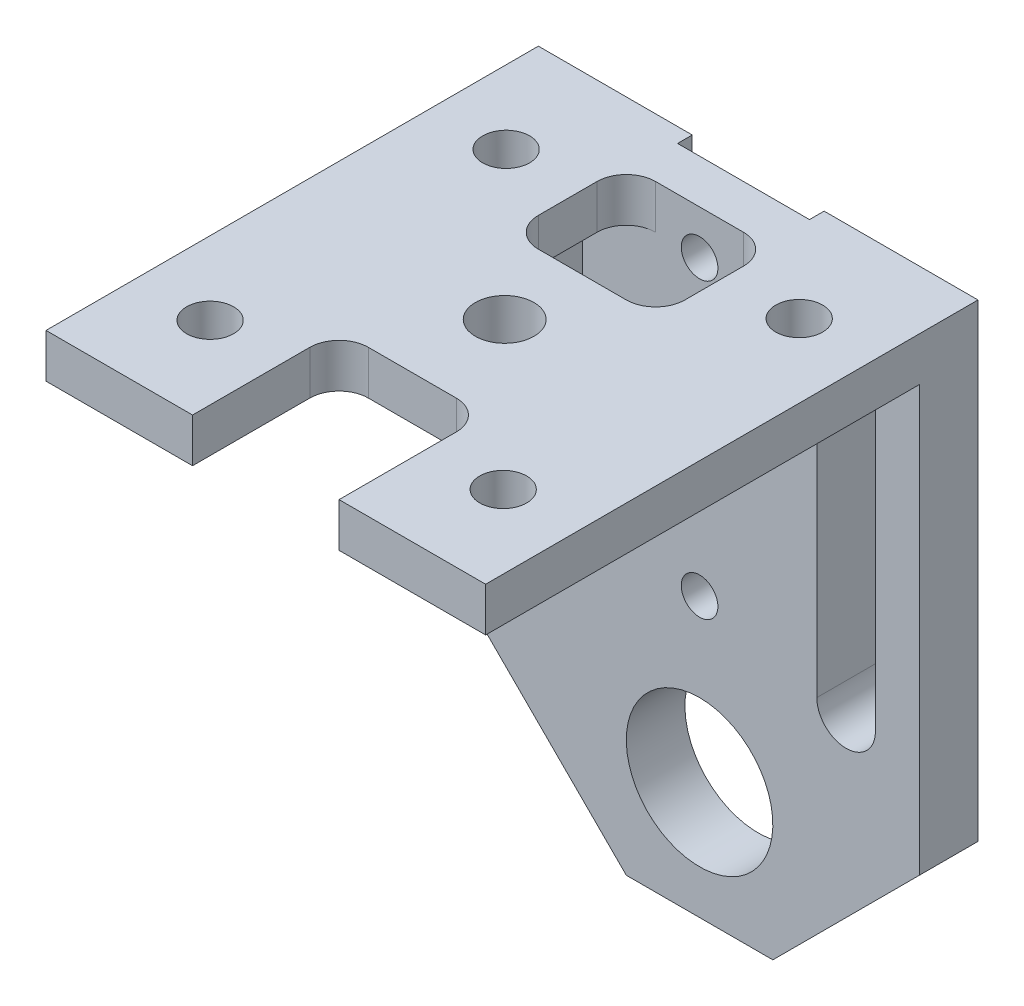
ISO-10303-21;
HEADER;
FILE_DESCRIPTION(('STEP AP214'),'2;1');
FILE_NAME('part.step','',(''),(''),'','','');
FILE_SCHEMA(('AUTOMOTIVE_DESIGN { 1 0 10303 214 1 1 1 1 }'));
ENDSEC;
DATA;
#1=APPLICATION_CONTEXT('core data for automotive mechanical design processes');
#2=APPLICATION_PROTOCOL_DEFINITION('international standard','automotive_design',2000,#1);
#3=PRODUCT_CONTEXT('',#1,'mechanical');
#4=PRODUCT('Part','Part','',(#3));
#5=PRODUCT_RELATED_PRODUCT_CATEGORY('part','',(#4));
#6=PRODUCT_DEFINITION_FORMATION('','',#4);
#7=PRODUCT_DEFINITION_CONTEXT('part definition',#1,'design');
#8=PRODUCT_DEFINITION('design','',#6,#7);
#9=PRODUCT_DEFINITION_SHAPE('','',#8);
#10=(LENGTH_UNIT() NAMED_UNIT(*) SI_UNIT(.MILLI.,.METRE.));
#11=(NAMED_UNIT(*) PLANE_ANGLE_UNIT() SI_UNIT($,.RADIAN.));
#12=(NAMED_UNIT(*) SI_UNIT($,.STERADIAN.) SOLID_ANGLE_UNIT());
#13=UNCERTAINTY_MEASURE_WITH_UNIT(LENGTH_MEASURE(1.E-05),#10,'distance_accuracy_value','');
#14=(GEOMETRIC_REPRESENTATION_CONTEXT(3) GLOBAL_UNCERTAINTY_ASSIGNED_CONTEXT((#13)) GLOBAL_UNIT_ASSIGNED_CONTEXT((#10,
#11,#12)) REPRESENTATION_CONTEXT('',''));
#15=CARTESIAN_POINT('',(0.,0.,0.));
#16=DIRECTION('',(0.,0.,1.));
#17=DIRECTION('',(1.,0.,0.));
#18=AXIS2_PLACEMENT_3D('',#15,#16,#17);
#19=CARTESIAN_POINT('',(30.,0.,0.));
#20=DIRECTION('',(0.,0.,-1.));
#21=DIRECTION('',(-1.,0.,0.));
#22=AXIS2_PLACEMENT_3D('',#19,#20,#21);
#23=PLANE('',#22);
#24=DIRECTION('',(-1.,0.,0.));
#25=VECTOR('',#24,1.);
#26=CARTESIAN_POINT('',(30.,0.,0.));
#27=LINE('',#26,#25);
#28=CARTESIAN_POINT('',(10.,0.,0.));
#29=VERTEX_POINT('',#28);
#30=CARTESIAN_POINT('',(0.,0.,0.));
#31=VERTEX_POINT('',#30);
#32=EDGE_CURVE('E493',#29,#31,#27,.T.);
#33=ORIENTED_EDGE('',*,*,#32,.F.);
#34=DIRECTION('',(0.,1.,0.));
#35=VECTOR('',#34,1.);
#36=CARTESIAN_POINT('',(10.,-39.001,0.));
#37=LINE('',#36,#35);
#38=CARTESIAN_POINT('',(10.,3.,0.));
#39=VERTEX_POINT('',#38);
#40=EDGE_CURVE('E418',#29,#39,#37,.T.);
#41=ORIENTED_EDGE('',*,*,#40,.T.);
#42=DIRECTION('',(-1.,0.,0.));
#43=VECTOR('',#42,1.);
#44=CARTESIAN_POINT('',(30.,3.,0.));
#45=LINE('',#44,#43);
#46=CARTESIAN_POINT('',(0.,3.,0.));
#47=VERTEX_POINT('',#46);
#48=EDGE_CURVE('E466',#39,#47,#45,.T.);
#49=ORIENTED_EDGE('',*,*,#48,.T.);
#50=DIRECTION('',(0.,-1.,0.));
#51=VECTOR('',#50,1.);
#52=CARTESIAN_POINT('',(0.,0.,0.));
#53=LINE('',#52,#51);
#54=EDGE_CURVE('E452',#47,#31,#53,.T.);
#55=ORIENTED_EDGE('',*,*,#54,.T.);
#56=EDGE_LOOP('',(#33,#41,#49,#55));
#57=FACE_BOUND('',#56,.T.);
#58=ADVANCED_FACE('F36',(#57),#23,.F.);
#59=CARTESIAN_POINT('',(30.,3.,0.));
#60=VERTEX_POINT('',#59);
#61=CARTESIAN_POINT('',(20.,3.,0.));
#62=VERTEX_POINT('',#61);
#63=EDGE_CURVE('E478',#60,#62,#45,.T.);
#64=ORIENTED_EDGE('',*,*,#63,.T.);
#65=DIRECTION('',(0.,1.,0.));
#66=VECTOR('',#65,1.);
#67=CARTESIAN_POINT('',(20.,-39.001,0.));
#68=LINE('',#67,#66);
#69=CARTESIAN_POINT('',(20.,0.,0.));
#70=VERTEX_POINT('',#69);
#71=EDGE_CURVE('E417',#70,#62,#68,.T.);
#72=ORIENTED_EDGE('',*,*,#71,.F.);
#73=CARTESIAN_POINT('',(30.,0.,0.));
#74=VERTEX_POINT('',#73);
#75=EDGE_CURVE('E494',#74,#70,#27,.T.);
#76=ORIENTED_EDGE('',*,*,#75,.F.);
#77=DIRECTION('',(0.,-1.,0.));
#78=VECTOR('',#77,1.);
#79=CARTESIAN_POINT('',(30.,0.,0.));
#80=LINE('',#79,#78);
#81=EDGE_CURVE('E453',#60,#74,#80,.T.);
#82=ORIENTED_EDGE('',*,*,#81,.F.);
#83=EDGE_LOOP('',(#64,#72,#76,#82));
#84=FACE_BOUND('',#83,.T.);
#85=ADVANCED_FACE('F647',(#84),#23,.F.);
#86=CARTESIAN_POINT('',(30.,0.,0.));
#87=DIRECTION('',(0.,1.,0.));
#88=DIRECTION('',(0.,0.,1.));
#89=AXIS2_PLACEMENT_3D('',#86,#87,#88);
#90=PLANE('',#89);
#91=CARTESIAN_POINT('',(15.,0.,-16.3));
#92=DIRECTION('',(0.,-1.,0.));
#93=DIRECTION('',(0.,0.,-1.));
#94=AXIS2_PLACEMENT_3D('',#91,#92,#93);
#95=CIRCLE('',#94,2.);
#96=CARTESIAN_POINT('',(15.,0.,-18.3));
#97=VERTEX_POINT('',#96);
#98=EDGE_CURVE('E856',#97,#97,#95,.T.);
#99=ORIENTED_EDGE('',*,*,#98,.F.);
#100=EDGE_LOOP('',(#99));
#101=FACE_BOUND('',#100,.T.);
#102=CARTESIAN_POINT('',(5.,0.,-26.4));
#103=DIRECTION('',(0.,1.,0.));
#104=DIRECTION('',(0.,0.,1.));
#105=AXIS2_PLACEMENT_3D('',#102,#103,#104);
#106=CIRCLE('',#105,1.6);
#107=CARTESIAN_POINT('',(5.,0.,-24.8));
#108=VERTEX_POINT('',#107);
#109=EDGE_CURVE('E425',#108,#108,#106,.T.);
#110=ORIENTED_EDGE('',*,*,#109,.T.);
#111=EDGE_LOOP('',(#110));
#112=FACE_BOUND('',#111,.T.);
#113=CARTESIAN_POINT('',(5.,0.,-6.2));
#114=DIRECTION('',(0.,1.,0.));
#115=DIRECTION('',(0.,0.,1.));
#116=AXIS2_PLACEMENT_3D('',#113,#114,#115);
#117=CIRCLE('',#116,1.6);
#118=CARTESIAN_POINT('',(5.,0.,-4.6));
#119=VERTEX_POINT('',#118);
#120=EDGE_CURVE('E431',#119,#119,#117,.T.);
#121=ORIENTED_EDGE('',*,*,#120,.T.);
#122=EDGE_LOOP('',(#121));
#123=FACE_BOUND('',#122,.T.);
#124=CARTESIAN_POINT('',(25.,0.,-6.2));
#125=DIRECTION('',(0.,1.,0.));
#126=DIRECTION('',(0.,0.,1.));
#127=AXIS2_PLACEMENT_3D('',#124,#125,#126);
#128=CIRCLE('',#127,1.6);
#129=CARTESIAN_POINT('',(25.,0.,-4.6));
#130=VERTEX_POINT('',#129);
#131=EDGE_CURVE('E437',#130,#130,#128,.T.);
#132=ORIENTED_EDGE('',*,*,#131,.T.);
#133=EDGE_LOOP('',(#132));
#134=FACE_BOUND('',#133,.T.);
#135=CARTESIAN_POINT('',(25.,0.,-26.4));
#136=DIRECTION('',(0.,1.,0.));
#137=DIRECTION('',(0.,0.,1.));
#138=AXIS2_PLACEMENT_3D('',#135,#136,#137);
#139=CIRCLE('',#138,1.6);
#140=CARTESIAN_POINT('',(25.,0.,-24.8));
#141=VERTEX_POINT('',#140);
#142=EDGE_CURVE('E443',#141,#141,#139,.T.);
#143=ORIENTED_EDGE('',*,*,#142,.T.);
#144=EDGE_LOOP('',(#143));
#145=FACE_BOUND('',#144,.T.);
#146=DIRECTION('',(-1.,0.,0.));
#147=VECTOR('',#146,1.);
#148=CARTESIAN_POINT('',(15.,0.,-21.6));
#149=LINE('',#148,#147);
#150=CARTESIAN_POINT('',(18.,0.,-21.6));
#151=VERTEX_POINT('',#150);
#152=CARTESIAN_POINT('',(12.,0.,-21.6));
#153=VERTEX_POINT('',#152);
#154=EDGE_CURVE('E360',#151,#153,#149,.T.);
#155=ORIENTED_EDGE('',*,*,#154,.F.);
#156=CARTESIAN_POINT('',(18.,0.,-23.6));
#157=DIRECTION('',(0.,1.,0.));
#158=DIRECTION('',(0.,0.,1.));
#159=AXIS2_PLACEMENT_3D('',#156,#157,#158);
#160=CIRCLE('',#159,2.);
#161=CARTESIAN_POINT('',(20.,0.,-23.6));
#162=VERTEX_POINT('',#161);
#163=EDGE_CURVE('E530',#151,#162,#160,.T.);
#164=ORIENTED_EDGE('',*,*,#163,.T.);
#165=DIRECTION('',(0.,0.,1.));
#166=VECTOR('',#165,1.);
#167=CARTESIAN_POINT('',(20.,0.,-21.6));
#168=LINE('',#167,#166);
#169=CARTESIAN_POINT('',(20.,0.,-27.6));
#170=VERTEX_POINT('',#169);
#171=EDGE_CURVE('E358',#170,#162,#168,.T.);
#172=ORIENTED_EDGE('',*,*,#171,.F.);
#173=CARTESIAN_POINT('',(18.,0.,-27.6));
#174=DIRECTION('',(0.,1.,0.));
#175=DIRECTION('',(0.,0.,1.));
#176=AXIS2_PLACEMENT_3D('',#173,#174,#175);
#177=CIRCLE('',#176,2.);
#178=CARTESIAN_POINT('',(18.,0.,-29.6));
#179=VERTEX_POINT('',#178);
#180=EDGE_CURVE('E555',#170,#179,#177,.T.);
#181=ORIENTED_EDGE('',*,*,#180,.T.);
#182=DIRECTION('',(-1.,0.,0.));
#183=VECTOR('',#182,1.);
#184=CARTESIAN_POINT('',(30.,0.,-29.6));
#185=LINE('',#184,#183);
#186=CARTESIAN_POINT('',(30.,0.,-29.6));
#187=VERTEX_POINT('',#186);
#188=EDGE_CURVE('E491',#187,#179,#185,.T.);
#189=ORIENTED_EDGE('',*,*,#188,.F.);
#190=DIRECTION('',(0.,0.,-1.));
#191=VECTOR('',#190,1.);
#192=CARTESIAN_POINT('',(30.,0.,0.));
#193=LINE('',#192,#191);
#194=EDGE_CURVE('E456',#74,#187,#193,.T.);
#195=ORIENTED_EDGE('',*,*,#194,.F.);
#196=ORIENTED_EDGE('',*,*,#75,.T.);
#197=DIRECTION('',(0.,0.,1.));
#198=VECTOR('',#197,1.);
#199=CARTESIAN_POINT('',(20.,0.,0.));
#200=LINE('',#199,#198);
#201=CARTESIAN_POINT('',(20.,0.,-8.));
#202=VERTEX_POINT('',#201);
#203=EDGE_CURVE('E399',#202,#70,#200,.T.);
#204=ORIENTED_EDGE('',*,*,#203,.F.);
#205=CARTESIAN_POINT('',(18.,0.,-8.));
#206=DIRECTION('',(0.,1.,0.));
#207=DIRECTION('',(0.,0.,1.));
#208=AXIS2_PLACEMENT_3D('',#205,#206,#207);
#209=CIRCLE('',#208,2.);
#210=CARTESIAN_POINT('',(18.,0.,-10.));
#211=VERTEX_POINT('',#210);
#212=EDGE_CURVE('E566',#202,#211,#209,.T.);
#213=ORIENTED_EDGE('',*,*,#212,.T.);
#214=DIRECTION('',(1.,0.,0.));
#215=VECTOR('',#214,1.);
#216=CARTESIAN_POINT('',(20.,0.,-10.));
#217=LINE('',#216,#215);
#218=CARTESIAN_POINT('',(12.,0.,-9.99999999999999));
#219=VERTEX_POINT('',#218);
#220=EDGE_CURVE('E403',#219,#211,#217,.T.);
#221=ORIENTED_EDGE('',*,*,#220,.F.);
#222=CARTESIAN_POINT('',(12.,0.,-8.));
#223=DIRECTION('',(0.,1.,0.));
#224=DIRECTION('',(0.,0.,1.));
#225=AXIS2_PLACEMENT_3D('',#222,#223,#224);
#226=CIRCLE('',#225,2.);
#227=CARTESIAN_POINT('',(10.,0.,-8.));
#228=VERTEX_POINT('',#227);
#229=EDGE_CURVE('E570',#219,#228,#226,.T.);
#230=ORIENTED_EDGE('',*,*,#229,.T.);
#231=DIRECTION('',(0.,0.,-1.));
#232=VECTOR('',#231,1.);
#233=CARTESIAN_POINT('',(10.,0.,-9.99999999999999));
#234=LINE('',#233,#232);
#235=EDGE_CURVE('E406',#29,#228,#234,.T.);
#236=ORIENTED_EDGE('',*,*,#235,.F.);
#237=ORIENTED_EDGE('',*,*,#32,.T.);
#238=DIRECTION('',(0.,0.,-1.));
#239=VECTOR('',#238,1.);
#240=CARTESIAN_POINT('',(0.,0.,0.));
#241=LINE('',#240,#239);
#242=CARTESIAN_POINT('',(0.,0.,-29.6));
#243=VERTEX_POINT('',#242);
#244=EDGE_CURVE('E469',#31,#243,#241,.T.);
#245=ORIENTED_EDGE('',*,*,#244,.T.);
#246=CARTESIAN_POINT('',(12.,0.,-29.6));
#247=VERTEX_POINT('',#246);
#248=EDGE_CURVE('E490',#247,#243,#185,.T.);
#249=ORIENTED_EDGE('',*,*,#248,.F.);
#250=CARTESIAN_POINT('',(12.,0.,-27.6));
#251=DIRECTION('',(0.,1.,0.));
#252=DIRECTION('',(0.,0.,1.));
#253=AXIS2_PLACEMENT_3D('',#250,#251,#252);
#254=CIRCLE('',#253,2.);
#255=CARTESIAN_POINT('',(10.,0.,-27.6));
#256=VERTEX_POINT('',#255);
#257=EDGE_CURVE('E560',#247,#256,#254,.T.);
#258=ORIENTED_EDGE('',*,*,#257,.T.);
#259=DIRECTION('',(0.,0.,-1.));
#260=VECTOR('',#259,1.);
#261=CARTESIAN_POINT('',(10.,0.,-29.6));
#262=LINE('',#261,#260);
#263=CARTESIAN_POINT('',(10.,0.,-23.6));
#264=VERTEX_POINT('',#263);
#265=EDGE_CURVE('E355',#264,#256,#262,.T.);
#266=ORIENTED_EDGE('',*,*,#265,.F.);
#267=CARTESIAN_POINT('',(12.,0.,-23.6));
#268=DIRECTION('',(0.,1.,0.));
#269=DIRECTION('',(0.,0.,1.));
#270=AXIS2_PLACEMENT_3D('',#267,#268,#269);
#271=CIRCLE('',#270,2.);
#272=EDGE_CURVE('E525',#264,#153,#271,.T.);
#273=ORIENTED_EDGE('',*,*,#272,.T.);
#274=EDGE_LOOP('',(#155,#164,#172,#181,#189,#195,#196,#204,#213,#221,#230,#236,#237,#245,#249,
#258,#266,#273));
#275=FACE_BOUND('',#274,.T.);
#276=ADVANCED_FACE('F651',(#101,#112,#123,#134,#145,#275),#90,.F.);
#277=CARTESIAN_POINT('',(30.,0.,-29.6));
#278=DIRECTION('',(0.,0.,-1.));
#279=DIRECTION('',(0.,1.,0.));
#280=AXIS2_PLACEMENT_3D('',#277,#278,#279);
#281=PLANE('',#280);
#282=DIRECTION('',(0.,1.,0.));
#283=VECTOR('',#282,1.);
#284=CARTESIAN_POINT('',(3.,0.,-29.6));
#285=LINE('',#284,#283);
#286=CARTESIAN_POINT('',(3.,-22.,-29.6));
#287=VERTEX_POINT('',#286);
#288=CARTESIAN_POINT('',(3.,-3.,-29.6));
#289=VERTEX_POINT('',#288);
#290=EDGE_CURVE('E308',#287,#289,#285,.T.);
#291=ORIENTED_EDGE('',*,*,#290,.T.);
#292=CARTESIAN_POINT('',(5.,-3.,-29.6));
#293=DIRECTION('',(0.,0.,-1.));
#294=DIRECTION('',(0.,1.,0.));
#295=AXIS2_PLACEMENT_3D('',#292,#293,#294);
#296=CIRCLE('',#295,2.);
#297=CARTESIAN_POINT('',(7.,-3.,-29.6));
#298=VERTEX_POINT('',#297);
#299=EDGE_CURVE('E311',#289,#298,#296,.T.);
#300=ORIENTED_EDGE('',*,*,#299,.T.);
#301=DIRECTION('',(0.,-1.,0.));
#302=VECTOR('',#301,1.);
#303=CARTESIAN_POINT('',(7.,0.,-29.6));
#304=LINE('',#303,#302);
#305=CARTESIAN_POINT('',(7.,-22.,-29.6));
#306=VERTEX_POINT('',#305);
#307=EDGE_CURVE('E303',#298,#306,#304,.T.);
#308=ORIENTED_EDGE('',*,*,#307,.T.);
#309=CARTESIAN_POINT('',(5.,-22.,-29.6));
#310=DIRECTION('',(0.,0.,-1.));
#311=DIRECTION('',(0.,1.,0.));
#312=AXIS2_PLACEMENT_3D('',#309,#310,#311);
#313=CIRCLE('',#312,2.);
#314=EDGE_CURVE('E278',#306,#287,#313,.T.);
#315=ORIENTED_EDGE('',*,*,#314,.T.);
#316=EDGE_LOOP('',(#291,#300,#308,#315));
#317=FACE_BOUND('',#316,.T.);
#318=DIRECTION('',(0.,1.,0.));
#319=VECTOR('',#318,1.);
#320=CARTESIAN_POINT('',(23.,0.,-29.6));
#321=LINE('',#320,#319);
#322=CARTESIAN_POINT('',(23.,-22.,-29.6));
#323=VERTEX_POINT('',#322);
#324=CARTESIAN_POINT('',(23.,-3.,-29.6));
#325=VERTEX_POINT('',#324);
#326=EDGE_CURVE('E340',#323,#325,#321,.T.);
#327=ORIENTED_EDGE('',*,*,#326,.T.);
#328=CARTESIAN_POINT('',(25.,-3.,-29.6));
#329=DIRECTION('',(0.,0.,-1.));
#330=DIRECTION('',(0.,1.,0.));
#331=AXIS2_PLACEMENT_3D('',#328,#329,#330);
#332=CIRCLE('',#331,2.);
#333=CARTESIAN_POINT('',(27.,-3.,-29.6));
#334=VERTEX_POINT('',#333);
#335=EDGE_CURVE('E343',#325,#334,#332,.T.);
#336=ORIENTED_EDGE('',*,*,#335,.T.);
#337=DIRECTION('',(0.,-1.,0.));
#338=VECTOR('',#337,1.);
#339=CARTESIAN_POINT('',(27.,0.,-29.6));
#340=LINE('',#339,#338);
#341=CARTESIAN_POINT('',(27.,-22.,-29.6));
#342=VERTEX_POINT('',#341);
#343=EDGE_CURVE('E328',#334,#342,#340,.T.);
#344=ORIENTED_EDGE('',*,*,#343,.T.);
#345=CARTESIAN_POINT('',(25.,-22.,-29.6));
#346=DIRECTION('',(0.,0.,-1.));
#347=DIRECTION('',(0.,1.,0.));
#348=AXIS2_PLACEMENT_3D('',#345,#346,#347);
#349=CIRCLE('',#348,2.);
#350=EDGE_CURVE('E337',#342,#323,#349,.T.);
#351=ORIENTED_EDGE('',*,*,#350,.T.);
#352=EDGE_LOOP('',(#327,#336,#344,#351));
#353=FACE_BOUND('',#352,.T.);
#354=DIRECTION('',(-1.,0.,0.));
#355=VECTOR('',#354,1.);
#356=CARTESIAN_POINT('',(30.,-39.,-29.6));
#357=LINE('',#356,#355);
#358=CARTESIAN_POINT('',(20.,-39.,-29.6));
#359=VERTEX_POINT('',#358);
#360=CARTESIAN_POINT('',(10.,-39.,-29.6));
#361=VERTEX_POINT('',#360);
#362=EDGE_CURVE('E488',#359,#361,#357,.T.);
#363=ORIENTED_EDGE('',*,*,#362,.F.);
#364=DIRECTION('',(-0.707106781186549,-0.707106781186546,0.));
#365=VECTOR('',#364,1.);
#366=CARTESIAN_POINT('',(30.,-29.,-29.6));
#367=LINE('',#366,#365);
#368=CARTESIAN_POINT('',(30.,-29.,-29.6));
#369=VERTEX_POINT('',#368);
#370=EDGE_CURVE('E44',#359,#369,#367,.F.);
#371=ORIENTED_EDGE('',*,*,#370,.T.);
#372=DIRECTION('',(0.,-1.,0.));
#373=VECTOR('',#372,1.);
#374=CARTESIAN_POINT('',(30.,0.,-29.6));
#375=LINE('',#374,#373);
#376=EDGE_CURVE('E459',#187,#369,#375,.T.);
#377=ORIENTED_EDGE('',*,*,#376,.F.);
#378=ORIENTED_EDGE('',*,*,#188,.T.);
#379=DIRECTION('',(0.,-1.,0.));
#380=VECTOR('',#379,1.);
#381=CARTESIAN_POINT('',(18.,3.,-29.6));
#382=LINE('',#381,#380);
#383=CARTESIAN_POINT('',(18.,3.,-29.6));
#384=VERTEX_POINT('',#383);
#385=EDGE_CURVE('E541',#179,#384,#382,.F.);
#386=ORIENTED_EDGE('',*,*,#385,.T.);
#387=DIRECTION('',(-1.,0.,0.));
#388=VECTOR('',#387,1.);
#389=CARTESIAN_POINT('',(20.,3.,-29.6));
#390=LINE('',#389,#388);
#391=CARTESIAN_POINT('',(12.,3.,-29.6));
#392=VERTEX_POINT('',#391);
#393=EDGE_CURVE('E346',#384,#392,#390,.T.);
#394=ORIENTED_EDGE('',*,*,#393,.T.);
#395=DIRECTION('',(0.,-1.,0.));
#396=VECTOR('',#395,1.);
#397=CARTESIAN_POINT('',(12.,0.,-29.6));
#398=LINE('',#397,#396);
#399=EDGE_CURVE('E538',#392,#247,#398,.T.);
#400=ORIENTED_EDGE('',*,*,#399,.T.);
#401=ORIENTED_EDGE('',*,*,#248,.T.);
#402=DIRECTION('',(0.,-1.,0.));
#403=VECTOR('',#402,1.);
#404=CARTESIAN_POINT('',(0.,0.,-29.6));
#405=LINE('',#404,#403);
#406=CARTESIAN_POINT('',(0.,-29.,-29.6));
#407=VERTEX_POINT('',#406);
#408=EDGE_CURVE('E472',#243,#407,#405,.T.);
#409=ORIENTED_EDGE('',*,*,#408,.T.);
#410=DIRECTION('',(0.707106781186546,-0.707106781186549,0.));
#411=VECTOR('',#410,1.);
#412=CARTESIAN_POINT('',(10.,-39.,-29.6));
#413=LINE('',#412,#411);
#414=EDGE_CURVE('E56',#407,#361,#413,.T.);
#415=ORIENTED_EDGE('',*,*,#414,.T.);
#416=EDGE_LOOP('',(#363,#371,#377,#378,#386,#394,#400,#401,#409,#415));
#417=FACE_BOUND('',#416,.T.);
#418=CARTESIAN_POINT('',(15.,-20.,-29.6));
#419=DIRECTION('',(0.,0.,-1.));
#420=DIRECTION('',(0.,1.,0.));
#421=AXIS2_PLACEMENT_3D('',#418,#419,#420);
#422=CIRCLE('',#421,1.24999999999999);
#423=CARTESIAN_POINT('',(15.,-18.75,-29.6));
#424=VERTEX_POINT('',#423);
#425=EDGE_CURVE('E368',#424,#424,#422,.T.);
#426=ORIENTED_EDGE('',*,*,#425,.T.);
#427=EDGE_LOOP('',(#426));
#428=FACE_BOUND('',#427,.T.);
#429=CARTESIAN_POINT('',(15.,-31.,-29.6));
#430=DIRECTION('',(0.,0.,-1.));
#431=DIRECTION('',(0.,1.,0.));
#432=AXIS2_PLACEMENT_3D('',#429,#430,#431);
#433=CIRCLE('',#432,5.);
#434=CARTESIAN_POINT('',(15.,-26.,-29.6));
#435=VERTEX_POINT('',#434);
#436=EDGE_CURVE('E449',#435,#435,#433,.T.);
#437=ORIENTED_EDGE('',*,*,#436,.T.);
#438=EDGE_LOOP('',(#437));
#439=FACE_BOUND('',#438,.T.);
#440=CARTESIAN_POINT('',(15.,0.,-29.6));
#441=DIRECTION('',(0.,0.,-1.));
#442=DIRECTION('',(0.,1.,0.));
#443=AXIS2_PLACEMENT_3D('',#440,#441,#442);
#444=CIRCLE('',#443,1.24999999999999);
#445=CARTESIAN_POINT('',(15.,1.24999999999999,-29.6));
#446=VERTEX_POINT('',#445);
#447=EDGE_CURVE('E374',#446,#446,#444,.T.);
#448=ORIENTED_EDGE('',*,*,#447,.T.);
#449=EDGE_LOOP('',(#448));
#450=FACE_BOUND('',#449,.T.);
#451=ADVANCED_FACE('F586',(#317,#353,#417,#428,#439,#450),#281,.F.);
#452=CARTESIAN_POINT('',(30.,-39.,-33.6));
#453=DIRECTION('',(0.,1.,0.));
#454=DIRECTION('',(0.,0.,1.));
#455=AXIS2_PLACEMENT_3D('',#452,#453,#454);
#456=PLANE('',#455);
#457=DIRECTION('',(-1.,0.,0.));
#458=VECTOR('',#457,1.);
#459=CARTESIAN_POINT('',(30.,-39.,-33.6));
#460=LINE('',#459,#458);
#461=CARTESIAN_POINT('',(20.,-39.,-33.6));
#462=VERTEX_POINT('',#461);
#463=CARTESIAN_POINT('',(10.,-39.,-33.6));
#464=VERTEX_POINT('',#463);
#465=EDGE_CURVE('E485',#462,#464,#460,.T.);
#466=ORIENTED_EDGE('',*,*,#465,.F.);
#467=DIRECTION('',(0.,0.,1.));
#468=VECTOR('',#467,1.);
#469=CARTESIAN_POINT('',(20.,-39.,-33.6));
#470=LINE('',#469,#468);
#471=EDGE_CURVE('E582',#462,#359,#470,.T.);
#472=ORIENTED_EDGE('',*,*,#471,.T.);
#473=ORIENTED_EDGE('',*,*,#362,.T.);
#474=DIRECTION('',(0.,0.,-1.));
#475=VECTOR('',#474,1.);
#476=CARTESIAN_POINT('',(10.,-39.,-33.6));
#477=LINE('',#476,#475);
#478=EDGE_CURVE('E579',#361,#464,#477,.T.);
#479=ORIENTED_EDGE('',*,*,#478,.T.);
#480=EDGE_LOOP('',(#466,#472,#473,#479));
#481=FACE_BOUND('',#480,.T.);
#482=ADVANCED_FACE('F600',(#481),#456,.F.);
#483=CARTESIAN_POINT('',(30.,3.,-33.6));
#484=DIRECTION('',(0.,0.,1.));
#485=DIRECTION('',(0.,-1.,0.));
#486=AXIS2_PLACEMENT_3D('',#483,#484,#485);
#487=PLANE('',#486);
#488=DIRECTION('',(0.,-1.,0.));
#489=VECTOR('',#488,1.);
#490=CARTESIAN_POINT('',(7.,-3.,-33.6));
#491=LINE('',#490,#489);
#492=CARTESIAN_POINT('',(7.,-3.,-33.6));
#493=VERTEX_POINT('',#492);
#494=CARTESIAN_POINT('',(7.,-22.,-33.6));
#495=VERTEX_POINT('',#494);
#496=EDGE_CURVE('E286',#493,#495,#491,.T.);
#497=ORIENTED_EDGE('',*,*,#496,.F.);
#498=CARTESIAN_POINT('',(5.,-3.,-33.6));
#499=DIRECTION('',(0.,0.,-1.));
#500=DIRECTION('',(0.,1.,0.));
#501=AXIS2_PLACEMENT_3D('',#498,#499,#500);
#502=CIRCLE('',#501,2.);
#503=CARTESIAN_POINT('',(3.,-3.,-33.6));
#504=VERTEX_POINT('',#503);
#505=EDGE_CURVE('E291',#504,#493,#502,.T.);
#506=ORIENTED_EDGE('',*,*,#505,.F.);
#507=DIRECTION('',(0.,1.,0.));
#508=VECTOR('',#507,1.);
#509=CARTESIAN_POINT('',(3.,-3.,-33.6));
#510=LINE('',#509,#508);
#511=CARTESIAN_POINT('',(3.,-22.,-33.6));
#512=VERTEX_POINT('',#511);
#513=EDGE_CURVE('E296',#512,#504,#510,.T.);
#514=ORIENTED_EDGE('',*,*,#513,.F.);
#515=CARTESIAN_POINT('',(5.,-22.,-33.6));
#516=DIRECTION('',(0.,0.,-1.));
#517=DIRECTION('',(0.,1.,0.));
#518=AXIS2_PLACEMENT_3D('',#515,#516,#517);
#519=CIRCLE('',#518,2.);
#520=EDGE_CURVE('E275',#495,#512,#519,.T.);
#521=ORIENTED_EDGE('',*,*,#520,.F.);
#522=EDGE_LOOP('',(#497,#506,#514,#521));
#523=FACE_BOUND('',#522,.T.);
#524=DIRECTION('',(0.,-1.,0.));
#525=VECTOR('',#524,1.);
#526=CARTESIAN_POINT('',(27.,-3.,-33.6));
#527=LINE('',#526,#525);
#528=CARTESIAN_POINT('',(27.,-3.,-33.6));
#529=VERTEX_POINT('',#528);
#530=CARTESIAN_POINT('',(27.,-22.,-33.6));
#531=VERTEX_POINT('',#530);
#532=EDGE_CURVE('E316',#529,#531,#527,.T.);
#533=ORIENTED_EDGE('',*,*,#532,.F.);
#534=CARTESIAN_POINT('',(25.,-3.,-33.6));
#535=DIRECTION('',(0.,0.,-1.));
#536=DIRECTION('',(0.,-1.,0.));
#537=AXIS2_PLACEMENT_3D('',#534,#535,#536);
#538=CIRCLE('',#537,2.);
#539=CARTESIAN_POINT('',(23.,-3.,-33.6));
#540=VERTEX_POINT('',#539);
#541=EDGE_CURVE('E314',#540,#529,#538,.T.);
#542=ORIENTED_EDGE('',*,*,#541,.F.);
#543=DIRECTION('',(0.,1.,0.));
#544=VECTOR('',#543,1.);
#545=CARTESIAN_POINT('',(23.,-3.,-33.6));
#546=LINE('',#545,#544);
#547=CARTESIAN_POINT('',(23.,-22.,-33.6));
#548=VERTEX_POINT('',#547);
#549=EDGE_CURVE('E322',#548,#540,#546,.T.);
#550=ORIENTED_EDGE('',*,*,#549,.F.);
#551=CARTESIAN_POINT('',(25.,-22.,-33.6));
#552=DIRECTION('',(0.,0.,-1.));
#553=DIRECTION('',(0.,-1.,0.));
#554=AXIS2_PLACEMENT_3D('',#551,#552,#553);
#555=CIRCLE('',#554,2.);
#556=EDGE_CURVE('E319',#531,#548,#555,.T.);
#557=ORIENTED_EDGE('',*,*,#556,.F.);
#558=EDGE_LOOP('',(#533,#542,#550,#557));
#559=FACE_BOUND('',#558,.T.);
#560=CARTESIAN_POINT('',(15.,-31.,-33.6));
#561=DIRECTION('',(0.,0.,-1.));
#562=DIRECTION('',(0.,1.,0.));
#563=AXIS2_PLACEMENT_3D('',#560,#561,#562);
#564=CIRCLE('',#563,5.);
#565=CARTESIAN_POINT('',(15.,-26.,-33.6));
#566=VERTEX_POINT('',#565);
#567=EDGE_CURVE('E446',#566,#566,#564,.T.);
#568=ORIENTED_EDGE('',*,*,#567,.F.);
#569=EDGE_LOOP('',(#568));
#570=FACE_BOUND('',#569,.T.);
#571=DIRECTION('',(0.,1.,0.));
#572=VECTOR('',#571,1.);
#573=CARTESIAN_POINT('',(30.,3.,-33.6));
#574=LINE('',#573,#572);
#575=CARTESIAN_POINT('',(30.,-29.,-33.6));
#576=VERTEX_POINT('',#575);
#577=CARTESIAN_POINT('',(30.,3.,-33.6));
#578=VERTEX_POINT('',#577);
#579=EDGE_CURVE('E462',#576,#578,#574,.T.);
#580=ORIENTED_EDGE('',*,*,#579,.F.);
#581=DIRECTION('',(0.707106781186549,0.707106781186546,0.));
#582=VECTOR('',#581,1.);
#583=CARTESIAN_POINT('',(30.,-29.,-33.6));
#584=LINE('',#583,#582);
#585=EDGE_CURVE('E577',#576,#462,#584,.F.);
#586=ORIENTED_EDGE('',*,*,#585,.T.);
#587=ORIENTED_EDGE('',*,*,#465,.T.);
#588=DIRECTION('',(-0.707106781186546,0.707106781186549,0.));
#589=VECTOR('',#588,1.);
#590=CARTESIAN_POINT('',(10.,-39.,-33.6));
#591=LINE('',#590,#589);
#592=CARTESIAN_POINT('',(0.,-28.9999999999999,-33.6));
#593=VERTEX_POINT('',#592);
#594=EDGE_CURVE('E575',#464,#593,#591,.T.);
#595=ORIENTED_EDGE('',*,*,#594,.T.);
#596=DIRECTION('',(0.,1.,0.));
#597=VECTOR('',#596,1.);
#598=CARTESIAN_POINT('',(0.,3.,-33.6));
#599=LINE('',#598,#597);
#600=CARTESIAN_POINT('',(0.,3.,-33.6));
#601=VERTEX_POINT('',#600);
#602=EDGE_CURVE('E474',#593,#601,#599,.T.);
#603=ORIENTED_EDGE('',*,*,#602,.T.);
#604=DIRECTION('',(-1.,0.,0.));
#605=VECTOR('',#604,1.);
#606=CARTESIAN_POINT('',(30.,3.,-33.6));
#607=LINE('',#606,#605);
#608=CARTESIAN_POINT('',(10.5,3.,-33.6));
#609=VERTEX_POINT('',#608);
#610=EDGE_CURVE('E481',#609,#601,#607,.T.);
#611=ORIENTED_EDGE('',*,*,#610,.F.);
#612=DIRECTION('',(0.,1.,0.));
#613=VECTOR('',#612,1.);
#614=CARTESIAN_POINT('',(10.5,3.,-33.6));
#615=LINE('',#614,#613);
#616=CARTESIAN_POINT('',(10.5,-23.,-33.6));
#617=VERTEX_POINT('',#616);
#618=EDGE_CURVE('E382',#617,#609,#615,.T.);
#619=ORIENTED_EDGE('',*,*,#618,.F.);
#620=CARTESIAN_POINT('',(12.5,-23.,-33.6));
#621=DIRECTION('',(0.,0.,1.));
#622=DIRECTION('',(0.,-1.,0.));
#623=AXIS2_PLACEMENT_3D('',#620,#621,#622);
#624=CIRCLE('',#623,2.);
#625=CARTESIAN_POINT('',(12.5,-25.,-33.6));
#626=VERTEX_POINT('',#625);
#627=EDGE_CURVE('E513',#617,#626,#624,.T.);
#628=ORIENTED_EDGE('',*,*,#627,.T.);
#629=DIRECTION('',(-1.,0.,0.));
#630=VECTOR('',#629,1.);
#631=CARTESIAN_POINT('',(19.5,-25.,-33.6));
#632=LINE('',#631,#630);
#633=CARTESIAN_POINT('',(17.5,-25.,-33.6));
#634=VERTEX_POINT('',#633);
#635=EDGE_CURVE('E393',#634,#626,#632,.T.);
#636=ORIENTED_EDGE('',*,*,#635,.F.);
#637=CARTESIAN_POINT('',(17.5,-23.,-33.6));
#638=DIRECTION('',(0.,0.,1.));
#639=DIRECTION('',(0.,-1.,0.));
#640=AXIS2_PLACEMENT_3D('',#637,#638,#639);
#641=CIRCLE('',#640,2.);
#642=CARTESIAN_POINT('',(19.5,-23.,-33.6));
#643=VERTEX_POINT('',#642);
#644=EDGE_CURVE('E511',#634,#643,#641,.T.);
#645=ORIENTED_EDGE('',*,*,#644,.T.);
#646=DIRECTION('',(0.,-1.,0.));
#647=VECTOR('',#646,1.);
#648=CARTESIAN_POINT('',(19.5,3.,-33.6));
#649=LINE('',#648,#647);
#650=CARTESIAN_POINT('',(19.5,3.,-33.6));
#651=VERTEX_POINT('',#650);
#652=EDGE_CURVE('E377',#651,#643,#649,.T.);
#653=ORIENTED_EDGE('',*,*,#652,.F.);
#654=EDGE_CURVE('E482',#578,#651,#607,.T.);
#655=ORIENTED_EDGE('',*,*,#654,.F.);
#656=EDGE_LOOP('',(#580,#586,#587,#595,#603,#611,#619,#628,#636,#645,#653,#655));
#657=FACE_BOUND('',#656,.T.);
#658=ADVANCED_FACE('F293',(#523,#559,#570,#657),#487,.F.);
#659=CARTESIAN_POINT('',(30.,3.,0.));
#660=DIRECTION('',(0.,-1.,0.));
#661=DIRECTION('',(0.,0.,-1.));
#662=AXIS2_PLACEMENT_3D('',#659,#660,#661);
#663=PLANE('',#662);
#664=CARTESIAN_POINT('',(15.,3.,-16.3));
#665=DIRECTION('',(0.,-1.,0.));
#666=DIRECTION('',(0.,0.,-1.));
#667=AXIS2_PLACEMENT_3D('',#664,#665,#666);
#668=CIRCLE('',#667,2.);
#669=CARTESIAN_POINT('',(15.,3.,-18.3));
#670=VERTEX_POINT('',#669);
#671=EDGE_CURVE('E854',#670,#670,#668,.T.);
#672=ORIENTED_EDGE('',*,*,#671,.T.);
#673=EDGE_LOOP('',(#672));
#674=FACE_BOUND('',#673,.T.);
#675=DIRECTION('',(0.,0.,-1.));
#676=VECTOR('',#675,1.);
#677=CARTESIAN_POINT('',(20.,3.,-21.6));
#678=LINE('',#677,#676);
#679=CARTESIAN_POINT('',(20.,3.,-23.6));
#680=VERTEX_POINT('',#679);
#681=CARTESIAN_POINT('',(20.,3.,-27.6));
#682=VERTEX_POINT('',#681);
#683=EDGE_CURVE('E349',#680,#682,#678,.T.);
#684=ORIENTED_EDGE('',*,*,#683,.F.);
#685=CARTESIAN_POINT('',(18.,3.,-23.6));
#686=DIRECTION('',(0.,-1.,0.));
#687=DIRECTION('',(0.,0.,-1.));
#688=AXIS2_PLACEMENT_3D('',#685,#686,#687);
#689=CIRCLE('',#688,2.);
#690=CARTESIAN_POINT('',(18.,3.,-21.6));
#691=VERTEX_POINT('',#690);
#692=EDGE_CURVE('E533',#680,#691,#689,.T.);
#693=ORIENTED_EDGE('',*,*,#692,.T.);
#694=DIRECTION('',(1.,0.,0.));
#695=VECTOR('',#694,1.);
#696=CARTESIAN_POINT('',(15.,3.,-21.6));
#697=LINE('',#696,#695);
#698=CARTESIAN_POINT('',(12.,3.,-21.6));
#699=VERTEX_POINT('',#698);
#700=EDGE_CURVE('E352',#699,#691,#697,.T.);
#701=ORIENTED_EDGE('',*,*,#700,.F.);
#702=CARTESIAN_POINT('',(12.,3.,-23.6));
#703=DIRECTION('',(0.,-1.,0.));
#704=DIRECTION('',(0.,0.,-1.));
#705=AXIS2_PLACEMENT_3D('',#702,#703,#704);
#706=CIRCLE('',#705,2.);
#707=CARTESIAN_POINT('',(10.,3.,-23.6));
#708=VERTEX_POINT('',#707);
#709=EDGE_CURVE('E527',#699,#708,#706,.T.);
#710=ORIENTED_EDGE('',*,*,#709,.T.);
#711=DIRECTION('',(0.,0.,1.));
#712=VECTOR('',#711,1.);
#713=CARTESIAN_POINT('',(10.,3.,-29.6));
#714=LINE('',#713,#712);
#715=CARTESIAN_POINT('',(10.,3.,-27.6));
#716=VERTEX_POINT('',#715);
#717=EDGE_CURVE('E363',#716,#708,#714,.T.);
#718=ORIENTED_EDGE('',*,*,#717,.F.);
#719=CARTESIAN_POINT('',(12.,3.,-27.6));
#720=DIRECTION('',(0.,-1.,0.));
#721=DIRECTION('',(0.,0.,-1.));
#722=AXIS2_PLACEMENT_3D('',#719,#720,#721);
#723=CIRCLE('',#722,2.);
#724=EDGE_CURVE('E562',#716,#392,#723,.T.);
#725=ORIENTED_EDGE('',*,*,#724,.T.);
#726=ORIENTED_EDGE('',*,*,#393,.F.);
#727=CARTESIAN_POINT('',(18.,3.,-27.6));
#728=DIRECTION('',(0.,-1.,0.));
#729=DIRECTION('',(0.,0.,-1.));
#730=AXIS2_PLACEMENT_3D('',#727,#728,#729);
#731=CIRCLE('',#730,2.);
#732=EDGE_CURVE('E558',#384,#682,#731,.T.);
#733=ORIENTED_EDGE('',*,*,#732,.T.);
#734=EDGE_LOOP('',(#684,#693,#701,#710,#718,#725,#726,#733));
#735=FACE_BOUND('',#734,.T.);
#736=ORIENTED_EDGE('',*,*,#654,.T.);
#737=DIRECTION('',(0.,0.,-1.));
#738=VECTOR('',#737,1.);
#739=CARTESIAN_POINT('',(19.5,3.,-32.6));
#740=LINE('',#739,#738);
#741=CARTESIAN_POINT('',(19.5,3.,-32.6));
#742=VERTEX_POINT('',#741);
#743=EDGE_CURVE('E397',#742,#651,#740,.T.);
#744=ORIENTED_EDGE('',*,*,#743,.F.);
#745=DIRECTION('',(1.,0.,0.));
#746=VECTOR('',#745,1.);
#747=CARTESIAN_POINT('',(19.5,3.,-32.6));
#748=LINE('',#747,#746);
#749=CARTESIAN_POINT('',(10.5,3.,-32.6));
#750=VERTEX_POINT('',#749);
#751=EDGE_CURVE('E387',#750,#742,#748,.T.);
#752=ORIENTED_EDGE('',*,*,#751,.F.);
#753=DIRECTION('',(0.,0.,-1.));
#754=VECTOR('',#753,1.);
#755=CARTESIAN_POINT('',(10.5,3.,-32.6));
#756=LINE('',#755,#754);
#757=EDGE_CURVE('E390',#750,#609,#756,.T.);
#758=ORIENTED_EDGE('',*,*,#757,.T.);
#759=ORIENTED_EDGE('',*,*,#610,.T.);
#760=DIRECTION('',(0.,0.,1.));
#761=VECTOR('',#760,1.);
#762=CARTESIAN_POINT('',(0.,3.,0.));
#763=LINE('',#762,#761);
#764=EDGE_CURVE('E457',#601,#47,#763,.T.);
#765=ORIENTED_EDGE('',*,*,#764,.T.);
#766=ORIENTED_EDGE('',*,*,#48,.F.);
#767=DIRECTION('',(0.,0.,1.));
#768=VECTOR('',#767,1.);
#769=CARTESIAN_POINT('',(10.,3.,-9.99999999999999));
#770=LINE('',#769,#768);
#771=CARTESIAN_POINT('',(10.,3.,-8.));
#772=VERTEX_POINT('',#771);
#773=EDGE_CURVE('E415',#772,#39,#770,.T.);
#774=ORIENTED_EDGE('',*,*,#773,.F.);
#775=CARTESIAN_POINT('',(12.,3.,-8.));
#776=DIRECTION('',(0.,-1.,0.));
#777=DIRECTION('',(0.,0.,-1.));
#778=AXIS2_PLACEMENT_3D('',#775,#776,#777);
#779=CIRCLE('',#778,2.);
#780=CARTESIAN_POINT('',(12.,3.,-9.99999999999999));
#781=VERTEX_POINT('',#780);
#782=EDGE_CURVE('E568',#772,#781,#779,.T.);
#783=ORIENTED_EDGE('',*,*,#782,.T.);
#784=DIRECTION('',(-1.,0.,0.));
#785=VECTOR('',#784,1.);
#786=CARTESIAN_POINT('',(20.,3.,-10.));
#787=LINE('',#786,#785);
#788=CARTESIAN_POINT('',(18.,3.,-10.));
#789=VERTEX_POINT('',#788);
#790=EDGE_CURVE('E412',#789,#781,#787,.T.);
#791=ORIENTED_EDGE('',*,*,#790,.F.);
#792=CARTESIAN_POINT('',(18.,3.,-8.));
#793=DIRECTION('',(0.,-1.,0.));
#794=DIRECTION('',(0.,0.,-1.));
#795=AXIS2_PLACEMENT_3D('',#792,#793,#794);
#796=CIRCLE('',#795,2.);
#797=CARTESIAN_POINT('',(20.,3.,-8.));
#798=VERTEX_POINT('',#797);
#799=EDGE_CURVE('E564',#789,#798,#796,.T.);
#800=ORIENTED_EDGE('',*,*,#799,.T.);
#801=DIRECTION('',(0.,0.,-1.));
#802=VECTOR('',#801,1.);
#803=CARTESIAN_POINT('',(20.,3.,0.));
#804=LINE('',#803,#802);
#805=EDGE_CURVE('E409',#62,#798,#804,.T.);
#806=ORIENTED_EDGE('',*,*,#805,.F.);
#807=ORIENTED_EDGE('',*,*,#63,.F.);
#808=DIRECTION('',(0.,0.,1.));
#809=VECTOR('',#808,1.);
#810=CARTESIAN_POINT('',(30.,3.,0.));
#811=LINE('',#810,#809);
#812=EDGE_CURVE('E464',#578,#60,#811,.T.);
#813=ORIENTED_EDGE('',*,*,#812,.F.);
#814=EDGE_LOOP('',(#736,#744,#752,#758,#759,#765,#766,#774,#783,#791,#800,#806,#807,#813));
#815=FACE_BOUND('',#814,.T.);
#816=CARTESIAN_POINT('',(5.,3.,-26.4));
#817=DIRECTION('',(0.,1.,0.));
#818=DIRECTION('',(0.,0.,-1.));
#819=AXIS2_PLACEMENT_3D('',#816,#817,#818);
#820=CIRCLE('',#819,1.6);
#821=CARTESIAN_POINT('',(5.,3.,-28.));
#822=VERTEX_POINT('',#821);
#823=EDGE_CURVE('E421',#822,#822,#820,.T.);
#824=ORIENTED_EDGE('',*,*,#823,.F.);
#825=EDGE_LOOP('',(#824));
#826=FACE_BOUND('',#825,.T.);
#827=CARTESIAN_POINT('',(5.,3.,-6.2));
#828=DIRECTION('',(0.,1.,0.));
#829=DIRECTION('',(0.,0.,-1.));
#830=AXIS2_PLACEMENT_3D('',#827,#828,#829);
#831=CIRCLE('',#830,1.6);
#832=CARTESIAN_POINT('',(5.,3.,-7.8));
#833=VERTEX_POINT('',#832);
#834=EDGE_CURVE('E428',#833,#833,#831,.T.);
#835=ORIENTED_EDGE('',*,*,#834,.F.);
#836=EDGE_LOOP('',(#835));
#837=FACE_BOUND('',#836,.T.);
#838=CARTESIAN_POINT('',(25.,3.,-6.2));
#839=DIRECTION('',(0.,1.,0.));
#840=DIRECTION('',(0.,0.,1.));
#841=AXIS2_PLACEMENT_3D('',#838,#839,#840);
#842=CIRCLE('',#841,1.6);
#843=CARTESIAN_POINT('',(25.,3.,-4.6));
#844=VERTEX_POINT('',#843);
#845=EDGE_CURVE('E434',#844,#844,#842,.T.);
#846=ORIENTED_EDGE('',*,*,#845,.F.);
#847=EDGE_LOOP('',(#846));
#848=FACE_BOUND('',#847,.T.);
#849=CARTESIAN_POINT('',(25.,3.,-26.4));
#850=DIRECTION('',(0.,1.,0.));
#851=DIRECTION('',(0.,0.,1.));
#852=AXIS2_PLACEMENT_3D('',#849,#850,#851);
#853=CIRCLE('',#852,1.6);
#854=CARTESIAN_POINT('',(25.,3.,-24.8));
#855=VERTEX_POINT('',#854);
#856=EDGE_CURVE('E440',#855,#855,#853,.T.);
#857=ORIENTED_EDGE('',*,*,#856,.F.);
#858=EDGE_LOOP('',(#857));
#859=FACE_BOUND('',#858,.T.);
#860=ADVANCED_FACE('F611',(#674,#735,#815,#826,#837,#848,#859),#663,.F.);
#861=CARTESIAN_POINT('',(30.,0.,0.));
#862=DIRECTION('',(-1.,0.,0.));
#863=DIRECTION('',(0.,0.,1.));
#864=AXIS2_PLACEMENT_3D('',#861,#862,#863);
#865=PLANE('',#864);
#866=ORIENTED_EDGE('',*,*,#376,.T.);
#867=DIRECTION('',(0.,0.,-1.));
#868=VECTOR('',#867,1.);
#869=CARTESIAN_POINT('',(30.,-29.,0.));
#870=LINE('',#869,#868);
#871=EDGE_CURVE('E572',#369,#576,#870,.T.);
#872=ORIENTED_EDGE('',*,*,#871,.T.);
#873=ORIENTED_EDGE('',*,*,#579,.T.);
#874=ORIENTED_EDGE('',*,*,#812,.T.);
#875=ORIENTED_EDGE('',*,*,#81,.T.);
#876=ORIENTED_EDGE('',*,*,#194,.T.);
#877=EDGE_LOOP('',(#866,#872,#873,#874,#875,#876));
#878=FACE_BOUND('',#877,.T.);
#879=ADVANCED_FACE('F592',(#878),#865,.F.);
#880=CARTESIAN_POINT('',(0.,0.,0.));
#881=DIRECTION('',(-1.,0.,0.));
#882=DIRECTION('',(0.,0.,1.));
#883=AXIS2_PLACEMENT_3D('',#880,#881,#882);
#884=PLANE('',#883);
#885=ORIENTED_EDGE('',*,*,#602,.F.);
#886=DIRECTION('',(0.,0.,1.));
#887=VECTOR('',#886,1.);
#888=CARTESIAN_POINT('',(0.,-29.,-29.6));
#889=LINE('',#888,#887);
#890=EDGE_CURVE('E11',#593,#407,#889,.T.);
#891=ORIENTED_EDGE('',*,*,#890,.T.);
#892=ORIENTED_EDGE('',*,*,#408,.F.);
#893=ORIENTED_EDGE('',*,*,#244,.F.);
#894=ORIENTED_EDGE('',*,*,#54,.F.);
#895=ORIENTED_EDGE('',*,*,#764,.F.);
#896=EDGE_LOOP('',(#885,#891,#892,#893,#894,#895));
#897=FACE_BOUND('',#896,.T.);
#898=ADVANCED_FACE('F606',(#897),#884,.T.);
#899=CARTESIAN_POINT('',(15.,-31.,-3.60000000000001));
#900=DIRECTION('',(0.,0.,-1.));
#901=DIRECTION('',(0.,1.,0.));
#902=AXIS2_PLACEMENT_3D('',#899,#900,#901);
#903=CYLINDRICAL_SURFACE('',#902,5.);
#904=ORIENTED_EDGE('',*,*,#567,.T.);
#905=EDGE_LOOP('',(#904));
#906=FACE_BOUND('',#905,.T.);
#907=ORIENTED_EDGE('',*,*,#436,.F.);
#908=EDGE_LOOP('',(#907));
#909=FACE_BOUND('',#908,.T.);
#910=ADVANCED_FACE('F814',(#906,#909),#903,.F.);
#911=CARTESIAN_POINT('',(25.,-1.,-26.4));
#912=DIRECTION('',(0.,1.,0.));
#913=DIRECTION('',(0.,0.,1.));
#914=AXIS2_PLACEMENT_3D('',#911,#912,#913);
#915=CYLINDRICAL_SURFACE('',#914,1.6);
#916=ORIENTED_EDGE('',*,*,#856,.T.);
#917=EDGE_LOOP('',(#916));
#918=FACE_BOUND('',#917,.T.);
#919=ORIENTED_EDGE('',*,*,#142,.F.);
#920=EDGE_LOOP('',(#919));
#921=FACE_BOUND('',#920,.T.);
#922=ADVANCED_FACE('F810',(#918,#921),#915,.F.);
#923=CARTESIAN_POINT('',(25.,-1.,-6.2));
#924=DIRECTION('',(0.,1.,0.));
#925=DIRECTION('',(0.,0.,1.));
#926=AXIS2_PLACEMENT_3D('',#923,#924,#925);
#927=CYLINDRICAL_SURFACE('',#926,1.6);
#928=ORIENTED_EDGE('',*,*,#845,.T.);
#929=EDGE_LOOP('',(#928));
#930=FACE_BOUND('',#929,.T.);
#931=ORIENTED_EDGE('',*,*,#131,.F.);
#932=EDGE_LOOP('',(#931));
#933=FACE_BOUND('',#932,.T.);
#934=ADVANCED_FACE('F803',(#930,#933),#927,.F.);
#935=CARTESIAN_POINT('',(5.,-1.,-6.2));
#936=DIRECTION('',(0.,1.,0.));
#937=DIRECTION('',(0.,0.,1.));
#938=AXIS2_PLACEMENT_3D('',#935,#936,#937);
#939=CYLINDRICAL_SURFACE('',#938,1.6);
#940=ORIENTED_EDGE('',*,*,#834,.T.);
#941=EDGE_LOOP('',(#940));
#942=FACE_BOUND('',#941,.T.);
#943=ORIENTED_EDGE('',*,*,#120,.F.);
#944=EDGE_LOOP('',(#943));
#945=FACE_BOUND('',#944,.T.);
#946=ADVANCED_FACE('F798',(#942,#945),#939,.F.);
#947=CARTESIAN_POINT('',(5.,-1.,-26.4));
#948=DIRECTION('',(0.,1.,0.));
#949=DIRECTION('',(0.,0.,1.));
#950=AXIS2_PLACEMENT_3D('',#947,#948,#949);
#951=CYLINDRICAL_SURFACE('',#950,1.6);
#952=ORIENTED_EDGE('',*,*,#823,.T.);
#953=EDGE_LOOP('',(#952));
#954=FACE_BOUND('',#953,.T.);
#955=ORIENTED_EDGE('',*,*,#109,.F.);
#956=EDGE_LOOP('',(#955));
#957=FACE_BOUND('',#956,.T.);
#958=ADVANCED_FACE('F794',(#954,#957),#951,.F.);
#959=CARTESIAN_POINT('',(10.,-39.001,-9.99999999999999));
#960=DIRECTION('',(-1.,0.,0.));
#961=DIRECTION('',(0.,0.,1.));
#962=AXIS2_PLACEMENT_3D('',#959,#960,#961);
#963=PLANE('',#962);
#964=ORIENTED_EDGE('',*,*,#235,.T.);
#965=DIRECTION('',(0.,1.,0.));
#966=VECTOR('',#965,1.);
#967=CARTESIAN_POINT('',(10.,3.,-8.));
#968=LINE('',#967,#966);
#969=EDGE_CURVE('E552',#228,#772,#968,.T.);
#970=ORIENTED_EDGE('',*,*,#969,.T.);
#971=ORIENTED_EDGE('',*,*,#773,.T.);
#972=ORIENTED_EDGE('',*,*,#40,.F.);
#973=EDGE_LOOP('',(#964,#970,#971,#972));
#974=FACE_BOUND('',#973,.T.);
#975=ADVANCED_FACE('F689',(#974),#963,.F.);
#976=CARTESIAN_POINT('',(20.,-39.001,-10.));
#977=DIRECTION('',(0.,0.,-1.));
#978=DIRECTION('',(-1.,0.,0.));
#979=AXIS2_PLACEMENT_3D('',#976,#977,#978);
#980=PLANE('',#979);
#981=ORIENTED_EDGE('',*,*,#220,.T.);
#982=DIRECTION('',(0.,1.,0.));
#983=VECTOR('',#982,1.);
#984=CARTESIAN_POINT('',(18.,3.,-10.));
#985=LINE('',#984,#983);
#986=EDGE_CURVE('E547',#211,#789,#985,.T.);
#987=ORIENTED_EDGE('',*,*,#986,.T.);
#988=ORIENTED_EDGE('',*,*,#790,.T.);
#989=DIRECTION('',(0.,1.,0.));
#990=VECTOR('',#989,1.);
#991=CARTESIAN_POINT('',(12.,0.,-9.99999999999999));
#992=LINE('',#991,#990);
#993=EDGE_CURVE('E545',#781,#219,#992,.F.);
#994=ORIENTED_EDGE('',*,*,#993,.T.);
#995=EDGE_LOOP('',(#981,#987,#988,#994));
#996=FACE_BOUND('',#995,.T.);
#997=ADVANCED_FACE('F698',(#996),#980,.F.);
#998=CARTESIAN_POINT('',(20.,-39.001,0.));
#999=DIRECTION('',(1.,0.,0.));
#1000=DIRECTION('',(0.,0.,-1.));
#1001=AXIS2_PLACEMENT_3D('',#998,#999,#1000);
#1002=PLANE('',#1001);
#1003=ORIENTED_EDGE('',*,*,#805,.T.);
#1004=DIRECTION('',(0.,1.,0.));
#1005=VECTOR('',#1004,1.);
#1006=CARTESIAN_POINT('',(20.,0.,-8.));
#1007=LINE('',#1006,#1005);
#1008=EDGE_CURVE('E550',#798,#202,#1007,.F.);
#1009=ORIENTED_EDGE('',*,*,#1008,.T.);
#1010=ORIENTED_EDGE('',*,*,#203,.T.);
#1011=ORIENTED_EDGE('',*,*,#71,.T.);
#1012=EDGE_LOOP('',(#1003,#1009,#1010,#1011));
#1013=FACE_BOUND('',#1012,.T.);
#1014=ADVANCED_FACE('F704',(#1013),#1002,.F.);
#1015=CARTESIAN_POINT('',(19.5,3.,-32.6));
#1016=DIRECTION('',(1.,0.,0.));
#1017=DIRECTION('',(0.,1.,0.));
#1018=AXIS2_PLACEMENT_3D('',#1015,#1016,#1017);
#1019=PLANE('',#1018);
#1020=ORIENTED_EDGE('',*,*,#652,.T.);
#1021=DIRECTION('',(0.,0.,-1.));
#1022=VECTOR('',#1021,1.);
#1023=CARTESIAN_POINT('',(19.5,-23.,-32.6));
#1024=LINE('',#1023,#1022);
#1025=CARTESIAN_POINT('',(19.5,-23.,-32.6));
#1026=VERTEX_POINT('',#1025);
#1027=EDGE_CURVE('E502',#643,#1026,#1024,.F.);
#1028=ORIENTED_EDGE('',*,*,#1027,.T.);
#1029=DIRECTION('',(0.,-1.,0.));
#1030=VECTOR('',#1029,1.);
#1031=CARTESIAN_POINT('',(19.5,3.,-32.6));
#1032=LINE('',#1031,#1030);
#1033=EDGE_CURVE('E378',#742,#1026,#1032,.T.);
#1034=ORIENTED_EDGE('',*,*,#1033,.F.);
#1035=ORIENTED_EDGE('',*,*,#743,.T.);
#1036=EDGE_LOOP('',(#1020,#1028,#1034,#1035));
#1037=FACE_BOUND('',#1036,.T.);
#1038=ADVANCED_FACE('F638',(#1037),#1019,.F.);
#1039=CARTESIAN_POINT('',(10.5,3.,-32.6));
#1040=DIRECTION('',(-1.,0.,0.));
#1041=DIRECTION('',(0.,-1.,0.));
#1042=AXIS2_PLACEMENT_3D('',#1039,#1040,#1041);
#1043=PLANE('',#1042);
#1044=DIRECTION('',(0.,1.,0.));
#1045=VECTOR('',#1044,1.);
#1046=CARTESIAN_POINT('',(10.5,3.,-32.6));
#1047=LINE('',#1046,#1045);
#1048=CARTESIAN_POINT('',(10.5,-23.,-32.6));
#1049=VERTEX_POINT('',#1048);
#1050=EDGE_CURVE('E385',#1049,#750,#1047,.T.);
#1051=ORIENTED_EDGE('',*,*,#1050,.F.);
#1052=DIRECTION('',(0.,0.,-1.));
#1053=VECTOR('',#1052,1.);
#1054=CARTESIAN_POINT('',(10.5,-23.,-33.6));
#1055=LINE('',#1054,#1053);
#1056=EDGE_CURVE('E508',#1049,#617,#1055,.T.);
#1057=ORIENTED_EDGE('',*,*,#1056,.T.);
#1058=ORIENTED_EDGE('',*,*,#618,.T.);
#1059=ORIENTED_EDGE('',*,*,#757,.F.);
#1060=EDGE_LOOP('',(#1051,#1057,#1058,#1059));
#1061=FACE_BOUND('',#1060,.T.);
#1062=ADVANCED_FACE('F620',(#1061),#1043,.F.);
#1063=CARTESIAN_POINT('',(19.5,-25.,-32.6));
#1064=DIRECTION('',(0.,-1.,0.));
#1065=DIRECTION('',(0.,0.,-1.));
#1066=AXIS2_PLACEMENT_3D('',#1063,#1064,#1065);
#1067=PLANE('',#1066);
#1068=DIRECTION('',(-1.,0.,0.));
#1069=VECTOR('',#1068,1.);
#1070=CARTESIAN_POINT('',(19.5,-25.,-32.6));
#1071=LINE('',#1070,#1069);
#1072=CARTESIAN_POINT('',(17.5,-25.,-32.6));
#1073=VERTEX_POINT('',#1072);
#1074=CARTESIAN_POINT('',(12.5,-25.,-32.6));
#1075=VERTEX_POINT('',#1074);
#1076=EDGE_CURVE('E381',#1073,#1075,#1071,.T.);
#1077=ORIENTED_EDGE('',*,*,#1076,.F.);
#1078=DIRECTION('',(0.,0.,-1.));
#1079=VECTOR('',#1078,1.);
#1080=CARTESIAN_POINT('',(17.5,-25.,-33.6));
#1081=LINE('',#1080,#1079);
#1082=EDGE_CURVE('E499',#1073,#634,#1081,.T.);
#1083=ORIENTED_EDGE('',*,*,#1082,.T.);
#1084=ORIENTED_EDGE('',*,*,#635,.T.);
#1085=DIRECTION('',(0.,0.,-1.));
#1086=VECTOR('',#1085,1.);
#1087=CARTESIAN_POINT('',(12.5,-25.,-32.6));
#1088=LINE('',#1087,#1086);
#1089=EDGE_CURVE('E497',#626,#1075,#1088,.F.);
#1090=ORIENTED_EDGE('',*,*,#1089,.T.);
#1091=EDGE_LOOP('',(#1077,#1083,#1084,#1090));
#1092=FACE_BOUND('',#1091,.T.);
#1093=ADVANCED_FACE('F628',(#1092),#1067,.F.);
#1094=CARTESIAN_POINT('',(0.,0.,-32.6));
#1095=DIRECTION('',(0.,0.,-1.));
#1096=DIRECTION('',(0.,1.,0.));
#1097=AXIS2_PLACEMENT_3D('',#1094,#1095,#1096);
#1098=PLANE('',#1097);
#1099=CARTESIAN_POINT('',(15.,-20.,-32.6));
#1100=DIRECTION('',(0.,0.,-1.));
#1101=DIRECTION('',(0.,1.,0.));
#1102=AXIS2_PLACEMENT_3D('',#1099,#1100,#1101);
#1103=CIRCLE('',#1102,1.24999999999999);
#1104=CARTESIAN_POINT('',(15.,-18.75,-32.6));
#1105=VERTEX_POINT('',#1104);
#1106=EDGE_CURVE('E365',#1105,#1105,#1103,.T.);
#1107=ORIENTED_EDGE('',*,*,#1106,.F.);
#1108=EDGE_LOOP('',(#1107));
#1109=FACE_BOUND('',#1108,.T.);
#1110=CARTESIAN_POINT('',(15.,0.,-32.6));
#1111=DIRECTION('',(0.,0.,-1.));
#1112=DIRECTION('',(0.,1.,0.));
#1113=AXIS2_PLACEMENT_3D('',#1110,#1111,#1112);
#1114=CIRCLE('',#1113,1.24999999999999);
#1115=CARTESIAN_POINT('',(15.,1.25,-32.6));
#1116=VERTEX_POINT('',#1115);
#1117=EDGE_CURVE('E371',#1116,#1116,#1114,.T.);
#1118=ORIENTED_EDGE('',*,*,#1117,.F.);
#1119=EDGE_LOOP('',(#1118));
#1120=FACE_BOUND('',#1119,.T.);
#1121=ORIENTED_EDGE('',*,*,#1033,.T.);
#1122=CARTESIAN_POINT('',(17.5,-23.,-32.6));
#1123=DIRECTION('',(0.,0.,-1.));
#1124=DIRECTION('',(0.,1.,0.));
#1125=AXIS2_PLACEMENT_3D('',#1122,#1123,#1124);
#1126=CIRCLE('',#1125,2.);
#1127=EDGE_CURVE('E506',#1026,#1073,#1126,.T.);
#1128=ORIENTED_EDGE('',*,*,#1127,.T.);
#1129=ORIENTED_EDGE('',*,*,#1076,.T.);
#1130=CARTESIAN_POINT('',(12.5,-23.,-32.6));
#1131=DIRECTION('',(0.,0.,-1.));
#1132=DIRECTION('',(0.,1.,0.));
#1133=AXIS2_PLACEMENT_3D('',#1130,#1131,#1132);
#1134=CIRCLE('',#1133,2.);
#1135=EDGE_CURVE('E504',#1075,#1049,#1134,.T.);
#1136=ORIENTED_EDGE('',*,*,#1135,.T.);
#1137=ORIENTED_EDGE('',*,*,#1050,.T.);
#1138=ORIENTED_EDGE('',*,*,#751,.T.);
#1139=EDGE_LOOP('',(#1121,#1128,#1129,#1136,#1137,#1138));
#1140=FACE_BOUND('',#1139,.T.);
#1141=ADVANCED_FACE('F631',(#1109,#1120,#1140),#1098,.T.);
#1142=CARTESIAN_POINT('',(15.,0.,-32.6));
#1143=DIRECTION('',(0.,0.,-1.));
#1144=DIRECTION('',(0.,1.,0.));
#1145=AXIS2_PLACEMENT_3D('',#1142,#1143,#1144);
#1146=CYLINDRICAL_SURFACE('',#1145,1.24999999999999);
#1147=ORIENTED_EDGE('',*,*,#1117,.T.);
#1148=EDGE_LOOP('',(#1147));
#1149=FACE_BOUND('',#1148,.T.);
#1150=ORIENTED_EDGE('',*,*,#447,.F.);
#1151=EDGE_LOOP('',(#1150));
#1152=FACE_BOUND('',#1151,.T.);
#1153=ADVANCED_FACE('F781',(#1149,#1152),#1146,.F.);
#1154=CARTESIAN_POINT('',(15.,-20.,-32.6));
#1155=DIRECTION('',(0.,0.,-1.));
#1156=DIRECTION('',(0.,1.,0.));
#1157=AXIS2_PLACEMENT_3D('',#1154,#1155,#1156);
#1158=CYLINDRICAL_SURFACE('',#1157,1.24999999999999);
#1159=ORIENTED_EDGE('',*,*,#1106,.T.);
#1160=EDGE_LOOP('',(#1159));
#1161=FACE_BOUND('',#1160,.T.);
#1162=ORIENTED_EDGE('',*,*,#425,.F.);
#1163=EDGE_LOOP('',(#1162));
#1164=FACE_BOUND('',#1163,.T.);
#1165=ADVANCED_FACE('F724',(#1161,#1164),#1158,.F.);
#1166=CARTESIAN_POINT('',(17.5,-23.,-32.6));
#1167=DIRECTION('',(0.,0.,1.));
#1168=DIRECTION('',(0.,-1.,0.));
#1169=AXIS2_PLACEMENT_3D('',#1166,#1167,#1168);
#1170=CYLINDRICAL_SURFACE('',#1169,2.);
#1171=ORIENTED_EDGE('',*,*,#1127,.F.);
#1172=ORIENTED_EDGE('',*,*,#1027,.F.);
#1173=ORIENTED_EDGE('',*,*,#644,.F.);
#1174=ORIENTED_EDGE('',*,*,#1082,.F.);
#1175=EDGE_LOOP('',(#1171,#1172,#1173,#1174));
#1176=FACE_BOUND('',#1175,.T.);
#1177=ADVANCED_FACE('F635',(#1176),#1170,.F.);
#1178=CARTESIAN_POINT('',(12.5,-23.,-32.6));
#1179=DIRECTION('',(0.,0.,1.));
#1180=DIRECTION('',(0.,-1.,0.));
#1181=AXIS2_PLACEMENT_3D('',#1178,#1179,#1180);
#1182=CYLINDRICAL_SURFACE('',#1181,2.);
#1183=ORIENTED_EDGE('',*,*,#1135,.F.);
#1184=ORIENTED_EDGE('',*,*,#1089,.F.);
#1185=ORIENTED_EDGE('',*,*,#627,.F.);
#1186=ORIENTED_EDGE('',*,*,#1056,.F.);
#1187=EDGE_LOOP('',(#1183,#1184,#1185,#1186));
#1188=FACE_BOUND('',#1187,.T.);
#1189=ADVANCED_FACE('F624',(#1188),#1182,.F.);
#1190=CARTESIAN_POINT('',(15.,3.001,-21.6));
#1191=DIRECTION('',(0.,0.,1.));
#1192=DIRECTION('',(1.,0.,0.));
#1193=AXIS2_PLACEMENT_3D('',#1190,#1191,#1192);
#1194=PLANE('',#1193);
#1195=ORIENTED_EDGE('',*,*,#154,.T.);
#1196=DIRECTION('',(0.,-1.,0.));
#1197=VECTOR('',#1196,1.);
#1198=CARTESIAN_POINT('',(12.,3.,-21.6));
#1199=LINE('',#1198,#1197);
#1200=EDGE_CURVE('E521',#153,#699,#1199,.F.);
#1201=ORIENTED_EDGE('',*,*,#1200,.T.);
#1202=ORIENTED_EDGE('',*,*,#700,.T.);
#1203=DIRECTION('',(0.,-1.,0.));
#1204=VECTOR('',#1203,1.);
#1205=CARTESIAN_POINT('',(18.,0.,-21.6));
#1206=LINE('',#1205,#1204);
#1207=EDGE_CURVE('E518',#691,#151,#1206,.T.);
#1208=ORIENTED_EDGE('',*,*,#1207,.T.);
#1209=EDGE_LOOP('',(#1195,#1201,#1202,#1208));
#1210=FACE_BOUND('',#1209,.T.);
#1211=ADVANCED_FACE('F675',(#1210),#1194,.F.);
#1212=CARTESIAN_POINT('',(20.,3.001,-21.6));
#1213=DIRECTION('',(1.,0.,0.));
#1214=DIRECTION('',(0.,0.,-1.));
#1215=AXIS2_PLACEMENT_3D('',#1212,#1213,#1214);
#1216=PLANE('',#1215);
#1217=ORIENTED_EDGE('',*,*,#683,.T.);
#1218=DIRECTION('',(0.,-1.,0.));
#1219=VECTOR('',#1218,1.);
#1220=CARTESIAN_POINT('',(20.,0.,-27.6));
#1221=LINE('',#1220,#1219);
#1222=EDGE_CURVE('E535',#682,#170,#1221,.T.);
#1223=ORIENTED_EDGE('',*,*,#1222,.T.);
#1224=ORIENTED_EDGE('',*,*,#171,.T.);
#1225=DIRECTION('',(0.,-1.,0.));
#1226=VECTOR('',#1225,1.);
#1227=CARTESIAN_POINT('',(20.,3.,-23.6));
#1228=LINE('',#1227,#1226);
#1229=EDGE_CURVE('E523',#162,#680,#1228,.F.);
#1230=ORIENTED_EDGE('',*,*,#1229,.T.);
#1231=EDGE_LOOP('',(#1217,#1223,#1224,#1230));
#1232=FACE_BOUND('',#1231,.T.);
#1233=ADVANCED_FACE('F666',(#1232),#1216,.F.);
#1234=CARTESIAN_POINT('',(10.,3.001,-29.6));
#1235=DIRECTION('',(-1.,0.,0.));
#1236=DIRECTION('',(0.,0.,1.));
#1237=AXIS2_PLACEMENT_3D('',#1234,#1235,#1236);
#1238=PLANE('',#1237);
#1239=ORIENTED_EDGE('',*,*,#265,.T.);
#1240=DIRECTION('',(0.,-1.,0.));
#1241=VECTOR('',#1240,1.);
#1242=CARTESIAN_POINT('',(10.,3.,-27.6));
#1243=LINE('',#1242,#1241);
#1244=EDGE_CURVE('E543',#256,#716,#1243,.F.);
#1245=ORIENTED_EDGE('',*,*,#1244,.T.);
#1246=ORIENTED_EDGE('',*,*,#717,.T.);
#1247=DIRECTION('',(0.,-1.,0.));
#1248=VECTOR('',#1247,1.);
#1249=CARTESIAN_POINT('',(10.,0.,-23.6));
#1250=LINE('',#1249,#1248);
#1251=EDGE_CURVE('E515',#708,#264,#1250,.T.);
#1252=ORIENTED_EDGE('',*,*,#1251,.T.);
#1253=EDGE_LOOP('',(#1239,#1245,#1246,#1252));
#1254=FACE_BOUND('',#1253,.T.);
#1255=ADVANCED_FACE('F729',(#1254),#1238,.F.);
#1256=CARTESIAN_POINT('',(12.,3.001,-23.6));
#1257=DIRECTION('',(0.,1.,0.));
#1258=DIRECTION('',(0.,0.,1.));
#1259=AXIS2_PLACEMENT_3D('',#1256,#1257,#1258);
#1260=CYLINDRICAL_SURFACE('',#1259,2.);
#1261=ORIENTED_EDGE('',*,*,#709,.F.);
#1262=ORIENTED_EDGE('',*,*,#1200,.F.);
#1263=ORIENTED_EDGE('',*,*,#272,.F.);
#1264=ORIENTED_EDGE('',*,*,#1251,.F.);
#1265=EDGE_LOOP('',(#1261,#1262,#1263,#1264));
#1266=FACE_BOUND('',#1265,.T.);
#1267=ADVANCED_FACE('F678',(#1266),#1260,.F.);
#1268=CARTESIAN_POINT('',(18.,3.001,-23.6));
#1269=DIRECTION('',(0.,1.,0.));
#1270=DIRECTION('',(0.,0.,1.));
#1271=AXIS2_PLACEMENT_3D('',#1268,#1269,#1270);
#1272=CYLINDRICAL_SURFACE('',#1271,2.);
#1273=ORIENTED_EDGE('',*,*,#692,.F.);
#1274=ORIENTED_EDGE('',*,*,#1229,.F.);
#1275=ORIENTED_EDGE('',*,*,#163,.F.);
#1276=ORIENTED_EDGE('',*,*,#1207,.F.);
#1277=EDGE_LOOP('',(#1273,#1274,#1275,#1276));
#1278=FACE_BOUND('',#1277,.T.);
#1279=ADVANCED_FACE('F671',(#1278),#1272,.F.);
#1280=CARTESIAN_POINT('',(18.,3.001,-27.6));
#1281=DIRECTION('',(0.,1.,0.));
#1282=DIRECTION('',(0.,0.,1.));
#1283=AXIS2_PLACEMENT_3D('',#1280,#1281,#1282);
#1284=CYLINDRICAL_SURFACE('',#1283,2.);
#1285=ORIENTED_EDGE('',*,*,#732,.F.);
#1286=ORIENTED_EDGE('',*,*,#385,.F.);
#1287=ORIENTED_EDGE('',*,*,#180,.F.);
#1288=ORIENTED_EDGE('',*,*,#1222,.F.);
#1289=EDGE_LOOP('',(#1285,#1286,#1287,#1288));
#1290=FACE_BOUND('',#1289,.T.);
#1291=ADVANCED_FACE('F664',(#1290),#1284,.F.);
#1292=CARTESIAN_POINT('',(12.,0.,-27.6));
#1293=DIRECTION('',(0.,1.,0.));
#1294=DIRECTION('',(0.,0.,1.));
#1295=AXIS2_PLACEMENT_3D('',#1292,#1293,#1294);
#1296=CYLINDRICAL_SURFACE('',#1295,2.);
#1297=ORIENTED_EDGE('',*,*,#724,.F.);
#1298=ORIENTED_EDGE('',*,*,#1244,.F.);
#1299=ORIENTED_EDGE('',*,*,#257,.F.);
#1300=ORIENTED_EDGE('',*,*,#399,.F.);
#1301=EDGE_LOOP('',(#1297,#1298,#1299,#1300));
#1302=FACE_BOUND('',#1301,.T.);
#1303=ADVANCED_FACE('F683',(#1302),#1296,.F.);
#1304=CARTESIAN_POINT('',(18.,-39.001,-8.));
#1305=DIRECTION('',(0.,-1.,0.));
#1306=DIRECTION('',(0.,0.,-1.));
#1307=AXIS2_PLACEMENT_3D('',#1304,#1305,#1306);
#1308=CYLINDRICAL_SURFACE('',#1307,2.);
#1309=ORIENTED_EDGE('',*,*,#212,.F.);
#1310=ORIENTED_EDGE('',*,*,#1008,.F.);
#1311=ORIENTED_EDGE('',*,*,#799,.F.);
#1312=ORIENTED_EDGE('',*,*,#986,.F.);
#1313=EDGE_LOOP('',(#1309,#1310,#1311,#1312));
#1314=FACE_BOUND('',#1313,.T.);
#1315=ADVANCED_FACE('F701',(#1314),#1308,.F.);
#1316=CARTESIAN_POINT('',(12.,-39.001,-8.));
#1317=DIRECTION('',(0.,-1.,0.));
#1318=DIRECTION('',(0.,0.,-1.));
#1319=AXIS2_PLACEMENT_3D('',#1316,#1317,#1318);
#1320=CYLINDRICAL_SURFACE('',#1319,2.);
#1321=ORIENTED_EDGE('',*,*,#229,.F.);
#1322=ORIENTED_EDGE('',*,*,#993,.F.);
#1323=ORIENTED_EDGE('',*,*,#782,.F.);
#1324=ORIENTED_EDGE('',*,*,#969,.F.);
#1325=EDGE_LOOP('',(#1321,#1322,#1323,#1324));
#1326=FACE_BOUND('',#1325,.T.);
#1327=ADVANCED_FACE('F695',(#1326),#1320,.F.);
#1328=CARTESIAN_POINT('',(25.,-3.,-23.6));
#1329=DIRECTION('',(0.,0.,-1.));
#1330=DIRECTION('',(0.,1.,0.));
#1331=AXIS2_PLACEMENT_3D('',#1328,#1329,#1330);
#1332=CYLINDRICAL_SURFACE('',#1331,2.);
#1333=DIRECTION('',(0.,0.,-1.));
#1334=VECTOR('',#1333,1.);
#1335=CARTESIAN_POINT('',(23.,-3.,-23.6));
#1336=LINE('',#1335,#1334);
#1337=EDGE_CURVE('E326',#325,#540,#1336,.T.);
#1338=ORIENTED_EDGE('',*,*,#1337,.T.);
#1339=ORIENTED_EDGE('',*,*,#541,.T.);
#1340=DIRECTION('',(0.,0.,-1.));
#1341=VECTOR('',#1340,1.);
#1342=CARTESIAN_POINT('',(27.,-3.,-23.6));
#1343=LINE('',#1342,#1341);
#1344=EDGE_CURVE('E325',#334,#529,#1343,.T.);
#1345=ORIENTED_EDGE('',*,*,#1344,.F.);
#1346=ORIENTED_EDGE('',*,*,#335,.F.);
#1347=EDGE_LOOP('',(#1338,#1339,#1345,#1346));
#1348=FACE_BOUND('',#1347,.T.);
#1349=ADVANCED_FACE('F739',(#1348),#1332,.F.);
#1350=CARTESIAN_POINT('',(23.,-3.,-23.6));
#1351=DIRECTION('',(-1.,0.,0.));
#1352=DIRECTION('',(0.,-1.,0.));
#1353=AXIS2_PLACEMENT_3D('',#1350,#1351,#1352);
#1354=PLANE('',#1353);
#1355=DIRECTION('',(0.,0.,-1.));
#1356=VECTOR('',#1355,1.);
#1357=CARTESIAN_POINT('',(23.,-22.,-23.6));
#1358=LINE('',#1357,#1356);
#1359=EDGE_CURVE('E329',#323,#548,#1358,.T.);
#1360=ORIENTED_EDGE('',*,*,#1359,.T.);
#1361=ORIENTED_EDGE('',*,*,#549,.T.);
#1362=ORIENTED_EDGE('',*,*,#1337,.F.);
#1363=ORIENTED_EDGE('',*,*,#326,.F.);
#1364=EDGE_LOOP('',(#1360,#1361,#1362,#1363));
#1365=FACE_BOUND('',#1364,.T.);
#1366=ADVANCED_FACE('F759',(#1365),#1354,.F.);
#1367=CARTESIAN_POINT('',(25.,-22.,-23.6));
#1368=DIRECTION('',(0.,0.,-1.));
#1369=DIRECTION('',(0.,1.,0.));
#1370=AXIS2_PLACEMENT_3D('',#1367,#1368,#1369);
#1371=CYLINDRICAL_SURFACE('',#1370,2.);
#1372=DIRECTION('',(0.,0.,-1.));
#1373=VECTOR('',#1372,1.);
#1374=CARTESIAN_POINT('',(27.,-22.,-23.6));
#1375=LINE('',#1374,#1373);
#1376=EDGE_CURVE('E331',#342,#531,#1375,.T.);
#1377=ORIENTED_EDGE('',*,*,#1376,.T.);
#1378=ORIENTED_EDGE('',*,*,#556,.T.);
#1379=ORIENTED_EDGE('',*,*,#1359,.F.);
#1380=ORIENTED_EDGE('',*,*,#350,.F.);
#1381=EDGE_LOOP('',(#1377,#1378,#1379,#1380));
#1382=FACE_BOUND('',#1381,.T.);
#1383=ADVANCED_FACE('F762',(#1382),#1371,.F.);
#1384=CARTESIAN_POINT('',(27.,-3.,-23.6));
#1385=DIRECTION('',(1.,0.,0.));
#1386=DIRECTION('',(0.,1.,0.));
#1387=AXIS2_PLACEMENT_3D('',#1384,#1385,#1386);
#1388=PLANE('',#1387);
#1389=ORIENTED_EDGE('',*,*,#1344,.T.);
#1390=ORIENTED_EDGE('',*,*,#532,.T.);
#1391=ORIENTED_EDGE('',*,*,#1376,.F.);
#1392=ORIENTED_EDGE('',*,*,#343,.F.);
#1393=EDGE_LOOP('',(#1389,#1390,#1391,#1392));
#1394=FACE_BOUND('',#1393,.T.);
#1395=ADVANCED_FACE('F757',(#1394),#1388,.F.);
#1396=CARTESIAN_POINT('',(5.,-3.,-23.6));
#1397=DIRECTION('',(0.,0.,-1.));
#1398=DIRECTION('',(0.,1.,0.));
#1399=AXIS2_PLACEMENT_3D('',#1396,#1397,#1398);
#1400=CYLINDRICAL_SURFACE('',#1399,2.);
#1401=DIRECTION('',(0.,0.,-1.));
#1402=VECTOR('',#1401,1.);
#1403=CARTESIAN_POINT('',(3.,-3.,-23.6));
#1404=LINE('',#1403,#1402);
#1405=EDGE_CURVE('E301',#289,#504,#1404,.T.);
#1406=ORIENTED_EDGE('',*,*,#1405,.T.);
#1407=ORIENTED_EDGE('',*,*,#505,.T.);
#1408=DIRECTION('',(0.,0.,-1.));
#1409=VECTOR('',#1408,1.);
#1410=CARTESIAN_POINT('',(7.,-3.,-23.6));
#1411=LINE('',#1410,#1409);
#1412=EDGE_CURVE('E282',#298,#493,#1411,.T.);
#1413=ORIENTED_EDGE('',*,*,#1412,.F.);
#1414=ORIENTED_EDGE('',*,*,#299,.F.);
#1415=EDGE_LOOP('',(#1406,#1407,#1413,#1414));
#1416=FACE_BOUND('',#1415,.T.);
#1417=ADVANCED_FACE('F754',(#1416),#1400,.F.);
#1418=CARTESIAN_POINT('',(3.,-3.,-23.6));
#1419=DIRECTION('',(-1.,0.,0.));
#1420=DIRECTION('',(0.,-1.,0.));
#1421=AXIS2_PLACEMENT_3D('',#1418,#1419,#1420);
#1422=PLANE('',#1421);
#1423=DIRECTION('',(0.,0.,-1.));
#1424=VECTOR('',#1423,1.);
#1425=CARTESIAN_POINT('',(3.,-22.,-23.6));
#1426=LINE('',#1425,#1424);
#1427=EDGE_CURVE('E281',#287,#512,#1426,.T.);
#1428=ORIENTED_EDGE('',*,*,#1427,.T.);
#1429=ORIENTED_EDGE('',*,*,#513,.T.);
#1430=ORIENTED_EDGE('',*,*,#1405,.F.);
#1431=ORIENTED_EDGE('',*,*,#290,.F.);
#1432=EDGE_LOOP('',(#1428,#1429,#1430,#1431));
#1433=FACE_BOUND('',#1432,.T.);
#1434=ADVANCED_FACE('F750',(#1433),#1422,.F.);
#1435=CARTESIAN_POINT('',(5.,-22.,-23.6));
#1436=DIRECTION('',(0.,0.,-1.));
#1437=DIRECTION('',(0.,1.,0.));
#1438=AXIS2_PLACEMENT_3D('',#1435,#1436,#1437);
#1439=CYLINDRICAL_SURFACE('',#1438,2.);
#1440=DIRECTION('',(0.,0.,-1.));
#1441=VECTOR('',#1440,1.);
#1442=CARTESIAN_POINT('',(7.,-22.,-23.6));
#1443=LINE('',#1442,#1441);
#1444=EDGE_CURVE('E270',#306,#495,#1443,.T.);
#1445=ORIENTED_EDGE('',*,*,#1444,.T.);
#1446=ORIENTED_EDGE('',*,*,#520,.T.);
#1447=ORIENTED_EDGE('',*,*,#1427,.F.);
#1448=ORIENTED_EDGE('',*,*,#314,.F.);
#1449=EDGE_LOOP('',(#1445,#1446,#1447,#1448));
#1450=FACE_BOUND('',#1449,.T.);
#1451=ADVANCED_FACE('F272',(#1450),#1439,.F.);
#1452=CARTESIAN_POINT('',(7.,-3.,-23.6));
#1453=DIRECTION('',(1.,0.,0.));
#1454=DIRECTION('',(0.,1.,0.));
#1455=AXIS2_PLACEMENT_3D('',#1452,#1453,#1454);
#1456=PLANE('',#1455);
#1457=ORIENTED_EDGE('',*,*,#1412,.T.);
#1458=ORIENTED_EDGE('',*,*,#496,.T.);
#1459=ORIENTED_EDGE('',*,*,#1444,.F.);
#1460=ORIENTED_EDGE('',*,*,#307,.F.);
#1461=EDGE_LOOP('',(#1457,#1458,#1459,#1460));
#1462=FACE_BOUND('',#1461,.T.);
#1463=ADVANCED_FACE('F287',(#1462),#1456,.F.);
#1464=CARTESIAN_POINT('',(30.,-29.,0.));
#1465=DIRECTION('',(-0.707106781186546,0.707106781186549,0.));
#1466=DIRECTION('',(0.,0.,-1.));
#1467=AXIS2_PLACEMENT_3D('',#1464,#1465,#1466);
#1468=PLANE('',#1467);
#1469=ORIENTED_EDGE('',*,*,#370,.F.);
#1470=ORIENTED_EDGE('',*,*,#471,.F.);
#1471=ORIENTED_EDGE('',*,*,#585,.F.);
#1472=ORIENTED_EDGE('',*,*,#871,.F.);
#1473=EDGE_LOOP('',(#1469,#1470,#1471,#1472));
#1474=FACE_BOUND('',#1473,.T.);
#1475=ADVANCED_FACE('F595',(#1474),#1468,.F.);
#1476=CARTESIAN_POINT('',(10.,-39.,-33.6));
#1477=DIRECTION('',(-0.707106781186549,-0.707106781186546,0.));
#1478=DIRECTION('',(0.,0.,1.));
#1479=AXIS2_PLACEMENT_3D('',#1476,#1477,#1478);
#1480=PLANE('',#1479);
#1481=ORIENTED_EDGE('',*,*,#414,.F.);
#1482=ORIENTED_EDGE('',*,*,#890,.F.);
#1483=ORIENTED_EDGE('',*,*,#594,.F.);
#1484=ORIENTED_EDGE('',*,*,#478,.F.);
#1485=EDGE_LOOP('',(#1481,#1482,#1483,#1484));
#1486=FACE_BOUND('',#1485,.T.);
#1487=ADVANCED_FACE('F38',(#1486),#1480,.T.);
#1488=CARTESIAN_POINT('',(15.,0.,-16.3));
#1489=DIRECTION('',(0.,-1.,0.));
#1490=DIRECTION('',(0.,0.,-1.));
#1491=AXIS2_PLACEMENT_3D('',#1488,#1489,#1490);
#1492=CYLINDRICAL_SURFACE('',#1491,2.);
#1493=ORIENTED_EDGE('',*,*,#671,.F.);
#1494=EDGE_LOOP('',(#1493));
#1495=FACE_BOUND('',#1494,.T.);
#1496=ORIENTED_EDGE('',*,*,#98,.T.);
#1497=EDGE_LOOP('',(#1496));
#1498=FACE_BOUND('',#1497,.T.);
#1499=ADVANCED_FACE('F745',(#1495,#1498),#1492,.F.);
#1500=CLOSED_SHELL('',(#58,#85,#276,#451,#482,#658,#860,#879,#898,#910,#922,#934,#946,#958,#975,
#997,#1014,#1038,#1062,#1093,#1141,#1153,#1165,#1177,#1189,#1211,#1233,#1255,#1267,#1279,#1291,
#1303,#1315,#1327,#1349,#1366,#1383,#1395,#1417,#1434,#1451,#1463,#1475,#1487,#1499));
#1501=MANIFOLD_SOLID_BREP('B2',#1500);
#1502=ADVANCED_BREP_SHAPE_REPRESENTATION('',(#18,#1501),#14);
#1503=SHAPE_DEFINITION_REPRESENTATION(#9,#1502);
ENDSEC;
END-ISO-10303-21;
